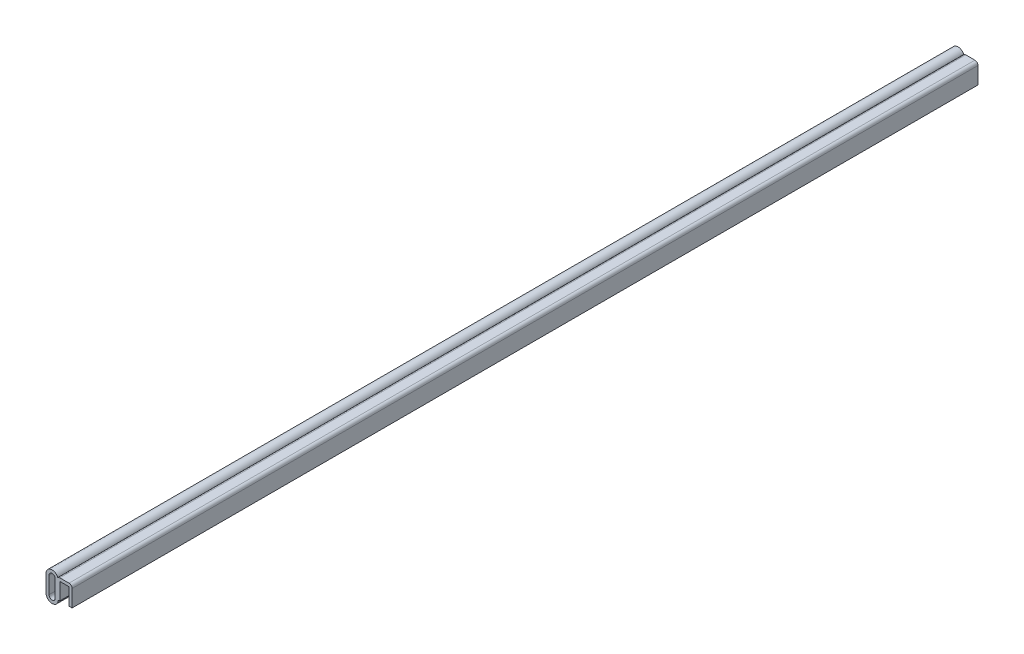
ISO-10303-21;
HEADER;
FILE_DESCRIPTION(('STEP AP214'),'2;1');
FILE_NAME('part.step','',(''),(''),'','','');
FILE_SCHEMA(('AUTOMOTIVE_DESIGN { 1 0 10303 214 1 1 1 1 }'));
ENDSEC;
DATA;
#1=APPLICATION_CONTEXT('core data for automotive mechanical design processes');
#2=APPLICATION_PROTOCOL_DEFINITION('international standard','automotive_design',2000,#1);
#3=PRODUCT_CONTEXT('',#1,'mechanical');
#4=PRODUCT('Part','Part','',(#3));
#5=PRODUCT_RELATED_PRODUCT_CATEGORY('part','',(#4));
#6=PRODUCT_DEFINITION_FORMATION('','',#4);
#7=PRODUCT_DEFINITION_CONTEXT('part definition',#1,'design');
#8=PRODUCT_DEFINITION('design','',#6,#7);
#9=PRODUCT_DEFINITION_SHAPE('','',#8);
#10=(LENGTH_UNIT() NAMED_UNIT(*) SI_UNIT(.MILLI.,.METRE.));
#11=(NAMED_UNIT(*) PLANE_ANGLE_UNIT() SI_UNIT($,.RADIAN.));
#12=(NAMED_UNIT(*) SI_UNIT($,.STERADIAN.) SOLID_ANGLE_UNIT());
#13=UNCERTAINTY_MEASURE_WITH_UNIT(LENGTH_MEASURE(1.E-05),#10,'distance_accuracy_value','');
#14=(GEOMETRIC_REPRESENTATION_CONTEXT(3) GLOBAL_UNCERTAINTY_ASSIGNED_CONTEXT((#13)) GLOBAL_UNIT_ASSIGNED_CONTEXT((#10,
#11,#12)) REPRESENTATION_CONTEXT('',''));
#15=CARTESIAN_POINT('',(0.,0.,0.));
#16=DIRECTION('',(0.,0.,1.));
#17=DIRECTION('',(1.,0.,0.));
#18=AXIS2_PLACEMENT_3D('',#15,#16,#17);
#19=CARTESIAN_POINT('',(-3.,-6.5,295.));
#20=DIRECTION('',(0.,-1.,0.));
#21=DIRECTION('',(0.,0.,-1.));
#22=AXIS2_PLACEMENT_3D('',#19,#20,#21);
#23=PLANE('',#22);
#24=DIRECTION('',(-1.,0.,0.));
#25=VECTOR('',#24,1.);
#26=CARTESIAN_POINT('',(-3.,-6.5,295.));
#27=LINE('',#26,#25);
#28=CARTESIAN_POINT('',(-3.,-6.5,295.));
#29=VERTEX_POINT('',#28);
#30=CARTESIAN_POINT('',(-4.,-6.5,295.));
#31=VERTEX_POINT('',#30);
#32=EDGE_CURVE('E222',#29,#31,#27,.T.);
#33=ORIENTED_EDGE('',*,*,#32,.T.);
#34=DIRECTION('',(0.,0.,-1.));
#35=VECTOR('',#34,1.);
#36=CARTESIAN_POINT('',(-4.,-6.5,295.));
#37=LINE('',#36,#35);
#38=CARTESIAN_POINT('',(-4.,-6.5,-295.));
#39=VERTEX_POINT('',#38);
#40=EDGE_CURVE('E208',#31,#39,#37,.T.);
#41=ORIENTED_EDGE('',*,*,#40,.T.);
#42=DIRECTION('',(-1.,0.,0.));
#43=VECTOR('',#42,1.);
#44=CARTESIAN_POINT('',(-3.,-6.5,-295.));
#45=LINE('',#44,#43);
#46=CARTESIAN_POINT('',(-3.,-6.5,-295.));
#47=VERTEX_POINT('',#46);
#48=EDGE_CURVE('E221',#47,#39,#45,.T.);
#49=ORIENTED_EDGE('',*,*,#48,.F.);
#50=DIRECTION('',(0.,0.,-1.));
#51=VECTOR('',#50,1.);
#52=CARTESIAN_POINT('',(-3.,-6.5,295.));
#53=LINE('',#52,#51);
#54=EDGE_CURVE('E269',#29,#47,#53,.T.);
#55=ORIENTED_EDGE('',*,*,#54,.F.);
#56=EDGE_LOOP('',(#33,#41,#49,#55));
#57=FACE_BOUND('',#56,.T.);
#58=ADVANCED_FACE('F46',(#57),#23,.T.);
#59=CARTESIAN_POINT('',(-3.,4.5,295.));
#60=DIRECTION('',(0.,0.,-1.));
#61=DIRECTION('',(-1.,0.,0.));
#62=AXIS2_PLACEMENT_3D('',#59,#60,#61);
#63=CYLINDRICAL_SURFACE('',#62,2.);
#64=CARTESIAN_POINT('',(-3.,4.5,-295.));
#65=DIRECTION('',(0.,0.,-1.));
#66=DIRECTION('',(-1.,0.,0.));
#67=AXIS2_PLACEMENT_3D('',#64,#65,#66);
#68=CIRCLE('',#67,2.);
#69=CARTESIAN_POINT('',(-4.3,6.01986841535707,-295.));
#70=VERTEX_POINT('',#69);
#71=CARTESIAN_POINT('',(-3.,6.5,-295.));
#72=VERTEX_POINT('',#71);
#73=EDGE_CURVE('E273',#70,#72,#68,.T.);
#74=ORIENTED_EDGE('',*,*,#73,.F.);
#75=DIRECTION('',(0.,0.,-1.));
#76=VECTOR('',#75,1.);
#77=CARTESIAN_POINT('',(-4.3,6.01986841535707,0.));
#78=LINE('',#77,#76);
#79=CARTESIAN_POINT('',(-4.3,6.01986841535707,295.));
#80=VERTEX_POINT('',#79);
#81=EDGE_CURVE('E13',#70,#80,#78,.F.);
#82=ORIENTED_EDGE('',*,*,#81,.T.);
#83=CARTESIAN_POINT('',(-3.,4.5,295.));
#84=DIRECTION('',(0.,0.,-1.));
#85=DIRECTION('',(-1.,0.,0.));
#86=AXIS2_PLACEMENT_3D('',#83,#84,#85);
#87=CIRCLE('',#86,2.);
#88=CARTESIAN_POINT('',(-3.,6.5,295.));
#89=VERTEX_POINT('',#88);
#90=EDGE_CURVE('E282',#89,#80,#87,.F.);
#91=ORIENTED_EDGE('',*,*,#90,.F.);
#92=DIRECTION('',(0.,0.,-1.));
#93=VECTOR('',#92,1.);
#94=CARTESIAN_POINT('',(-3.,6.5,295.));
#95=LINE('',#94,#93);
#96=EDGE_CURVE('E278',#72,#89,#95,.F.);
#97=ORIENTED_EDGE('',*,*,#96,.F.);
#98=EDGE_LOOP('',(#74,#82,#91,#97));
#99=FACE_BOUND('',#98,.T.);
#100=ADVANCED_FACE('F291',(#99),#63,.T.);
#101=CARTESIAN_POINT('',(-3.,-6.5,295.));
#102=DIRECTION('',(1.,0.,0.));
#103=DIRECTION('',(0.,0.,-1.));
#104=AXIS2_PLACEMENT_3D('',#101,#102,#103);
#105=PLANE('',#104);
#106=DIRECTION('',(0.,1.,0.));
#107=VECTOR('',#106,1.);
#108=CARTESIAN_POINT('',(-3.,-6.5,-295.));
#109=LINE('',#108,#107);
#110=CARTESIAN_POINT('',(-3.,4.5,-295.));
#111=VERTEX_POINT('',#110);
#112=EDGE_CURVE('E246',#111,#47,#109,.F.);
#113=ORIENTED_EDGE('',*,*,#112,.F.);
#114=DIRECTION('',(0.,0.,-1.));
#115=VECTOR('',#114,1.);
#116=CARTESIAN_POINT('',(-3.,4.5,295.));
#117=LINE('',#116,#115);
#118=CARTESIAN_POINT('',(-3.,4.5,295.));
#119=VERTEX_POINT('',#118);
#120=EDGE_CURVE('E267',#119,#111,#117,.T.);
#121=ORIENTED_EDGE('',*,*,#120,.F.);
#122=DIRECTION('',(0.,1.,0.));
#123=VECTOR('',#122,1.);
#124=CARTESIAN_POINT('',(-3.,-6.5,295.));
#125=LINE('',#124,#123);
#126=EDGE_CURVE('E225',#119,#29,#125,.F.);
#127=ORIENTED_EDGE('',*,*,#126,.T.);
#128=ORIENTED_EDGE('',*,*,#54,.T.);
#129=EDGE_LOOP('',(#113,#121,#127,#128));
#130=FACE_BOUND('',#129,.T.);
#131=ADVANCED_FACE('F313',(#130),#105,.T.);
#132=CARTESIAN_POINT('',(-5.,4.5,295.));
#133=DIRECTION('',(0.,-1.,0.));
#134=DIRECTION('',(0.,0.,-1.));
#135=AXIS2_PLACEMENT_3D('',#132,#133,#134);
#136=PLANE('',#135);
#137=DIRECTION('',(1.,0.,0.));
#138=VECTOR('',#137,1.);
#139=CARTESIAN_POINT('',(-5.,4.5,-295.));
#140=LINE('',#139,#138);
#141=CARTESIAN_POINT('',(3.,4.5,-295.));
#142=VERTEX_POINT('',#141);
#143=EDGE_CURVE('E249',#142,#111,#140,.F.);
#144=ORIENTED_EDGE('',*,*,#143,.F.);
#145=DIRECTION('',(0.,0.,-1.));
#146=VECTOR('',#145,1.);
#147=CARTESIAN_POINT('',(3.,4.5,295.));
#148=LINE('',#147,#146);
#149=CARTESIAN_POINT('',(3.,4.5,295.));
#150=VERTEX_POINT('',#149);
#151=EDGE_CURVE('E265',#150,#142,#148,.T.);
#152=ORIENTED_EDGE('',*,*,#151,.F.);
#153=DIRECTION('',(1.,0.,0.));
#154=VECTOR('',#153,1.);
#155=CARTESIAN_POINT('',(-5.,4.5,295.));
#156=LINE('',#155,#154);
#157=EDGE_CURVE('E229',#150,#119,#156,.F.);
#158=ORIENTED_EDGE('',*,*,#157,.T.);
#159=ORIENTED_EDGE('',*,*,#120,.T.);
#160=EDGE_LOOP('',(#144,#152,#158,#159));
#161=FACE_BOUND('',#160,.T.);
#162=ADVANCED_FACE('F318',(#161),#136,.T.);
#163=CARTESIAN_POINT('',(3.,-6.5,295.));
#164=DIRECTION('',(-1.,0.,0.));
#165=DIRECTION('',(0.,0.,1.));
#166=AXIS2_PLACEMENT_3D('',#163,#164,#165);
#167=PLANE('',#166);
#168=DIRECTION('',(0.,1.,0.));
#169=VECTOR('',#168,1.);
#170=CARTESIAN_POINT('',(3.,-6.5,-295.));
#171=LINE('',#170,#169);
#172=CARTESIAN_POINT('',(3.,-6.5,-295.));
#173=VERTEX_POINT('',#172);
#174=EDGE_CURVE('E252',#173,#142,#171,.T.);
#175=ORIENTED_EDGE('',*,*,#174,.F.);
#176=DIRECTION('',(0.,0.,-1.));
#177=VECTOR('',#176,1.);
#178=CARTESIAN_POINT('',(3.,-6.5,295.));
#179=LINE('',#178,#177);
#180=CARTESIAN_POINT('',(3.,-6.5,295.));
#181=VERTEX_POINT('',#180);
#182=EDGE_CURVE('E263',#181,#173,#179,.T.);
#183=ORIENTED_EDGE('',*,*,#182,.F.);
#184=DIRECTION('',(0.,1.,0.));
#185=VECTOR('',#184,1.);
#186=CARTESIAN_POINT('',(3.,-6.5,295.));
#187=LINE('',#186,#185);
#188=EDGE_CURVE('E232',#181,#150,#187,.T.);
#189=ORIENTED_EDGE('',*,*,#188,.T.);
#190=ORIENTED_EDGE('',*,*,#151,.T.);
#191=EDGE_LOOP('',(#175,#183,#189,#190));
#192=FACE_BOUND('',#191,.T.);
#193=ADVANCED_FACE('F321',(#192),#167,.T.);
#194=CARTESIAN_POINT('',(5.,-6.5,295.));
#195=DIRECTION('',(0.,-1.,0.));
#196=DIRECTION('',(0.,0.,-1.));
#197=AXIS2_PLACEMENT_3D('',#194,#195,#196);
#198=PLANE('',#197);
#199=DIRECTION('',(-1.,0.,0.));
#200=VECTOR('',#199,1.);
#201=CARTESIAN_POINT('',(5.,-6.5,-295.));
#202=LINE('',#201,#200);
#203=CARTESIAN_POINT('',(5.,-6.5,-295.));
#204=VERTEX_POINT('',#203);
#205=EDGE_CURVE('E255',#204,#173,#202,.T.);
#206=ORIENTED_EDGE('',*,*,#205,.F.);
#207=DIRECTION('',(0.,0.,-1.));
#208=VECTOR('',#207,1.);
#209=CARTESIAN_POINT('',(5.,-6.5,295.));
#210=LINE('',#209,#208);
#211=CARTESIAN_POINT('',(5.,-6.5,295.));
#212=VERTEX_POINT('',#211);
#213=EDGE_CURVE('E243',#212,#204,#210,.T.);
#214=ORIENTED_EDGE('',*,*,#213,.F.);
#215=DIRECTION('',(-1.,0.,0.));
#216=VECTOR('',#215,1.);
#217=CARTESIAN_POINT('',(5.,-6.5,295.));
#218=LINE('',#217,#216);
#219=EDGE_CURVE('E235',#212,#181,#218,.T.);
#220=ORIENTED_EDGE('',*,*,#219,.T.);
#221=ORIENTED_EDGE('',*,*,#182,.T.);
#222=EDGE_LOOP('',(#206,#214,#220,#221));
#223=FACE_BOUND('',#222,.T.);
#224=ADVANCED_FACE('F325',(#223),#198,.T.);
#225=CARTESIAN_POINT('',(5.,-6.5,295.));
#226=DIRECTION('',(-1.,0.,0.));
#227=DIRECTION('',(0.,0.,1.));
#228=AXIS2_PLACEMENT_3D('',#225,#226,#227);
#229=PLANE('',#228);
#230=DIRECTION('',(0.,1.,0.));
#231=VECTOR('',#230,1.);
#232=CARTESIAN_POINT('',(5.,-6.5,-295.));
#233=LINE('',#232,#231);
#234=CARTESIAN_POINT('',(5.,4.5,-295.));
#235=VERTEX_POINT('',#234);
#236=EDGE_CURVE('E258',#204,#235,#233,.T.);
#237=ORIENTED_EDGE('',*,*,#236,.T.);
#238=DIRECTION('',(0.,0.,-1.));
#239=VECTOR('',#238,1.);
#240=CARTESIAN_POINT('',(5.,4.5,295.));
#241=LINE('',#240,#239);
#242=CARTESIAN_POINT('',(5.,4.5,295.));
#243=VERTEX_POINT('',#242);
#244=EDGE_CURVE('E54',#235,#243,#241,.F.);
#245=ORIENTED_EDGE('',*,*,#244,.T.);
#246=DIRECTION('',(0.,1.,0.));
#247=VECTOR('',#246,1.);
#248=CARTESIAN_POINT('',(5.,-6.5,295.));
#249=LINE('',#248,#247);
#250=EDGE_CURVE('E238',#212,#243,#249,.T.);
#251=ORIENTED_EDGE('',*,*,#250,.F.);
#252=ORIENTED_EDGE('',*,*,#213,.T.);
#253=EDGE_LOOP('',(#237,#245,#251,#252));
#254=FACE_BOUND('',#253,.T.);
#255=ADVANCED_FACE('F327',(#254),#229,.F.);
#256=CARTESIAN_POINT('',(-5.,6.5,295.));
#257=DIRECTION('',(0.,-1.,0.));
#258=DIRECTION('',(0.,0.,-1.));
#259=AXIS2_PLACEMENT_3D('',#256,#257,#258);
#260=PLANE('',#259);
#261=DIRECTION('',(-1.,0.,0.));
#262=VECTOR('',#261,1.);
#263=CARTESIAN_POINT('',(-5.,6.5,-295.));
#264=LINE('',#263,#262);
#265=CARTESIAN_POINT('',(3.,6.5,-295.));
#266=VERTEX_POINT('',#265);
#267=EDGE_CURVE('E226',#266,#72,#264,.T.);
#268=ORIENTED_EDGE('',*,*,#267,.T.);
#269=ORIENTED_EDGE('',*,*,#96,.T.);
#270=DIRECTION('',(-1.,0.,0.));
#271=VECTOR('',#270,1.);
#272=CARTESIAN_POINT('',(-5.,6.5,295.));
#273=LINE('',#272,#271);
#274=CARTESIAN_POINT('',(3.,6.5,295.));
#275=VERTEX_POINT('',#274);
#276=EDGE_CURVE('E240',#275,#89,#273,.T.);
#277=ORIENTED_EDGE('',*,*,#276,.F.);
#278=DIRECTION('',(0.,0.,-1.));
#279=VECTOR('',#278,1.);
#280=CARTESIAN_POINT('',(3.,6.5,295.));
#281=LINE('',#280,#279);
#282=EDGE_CURVE('E275',#275,#266,#281,.T.);
#283=ORIENTED_EDGE('',*,*,#282,.T.);
#284=EDGE_LOOP('',(#268,#269,#277,#283));
#285=FACE_BOUND('',#284,.T.);
#286=ADVANCED_FACE('F332',(#285),#260,.F.);
#287=CARTESIAN_POINT('',(-5.,-6.5,295.));
#288=DIRECTION('',(0.,0.,-1.));
#289=DIRECTION('',(-1.,0.,0.));
#290=AXIS2_PLACEMENT_3D('',#287,#288,#289);
#291=PLANE('',#290);
#292=CARTESIAN_POINT('',(-8.,-6.5,295.));
#293=DIRECTION('',(0.,0.,1.));
#294=DIRECTION('',(1.,0.,0.));
#295=AXIS2_PLACEMENT_3D('',#292,#293,#294);
#296=CIRCLE('',#295,4.);
#297=CARTESIAN_POINT('',(-12.,-6.5,295.));
#298=VERTEX_POINT('',#297);
#299=EDGE_CURVE('E206',#298,#31,#296,.T.);
#300=ORIENTED_EDGE('',*,*,#299,.T.);
#301=ORIENTED_EDGE('',*,*,#32,.F.);
#302=ORIENTED_EDGE('',*,*,#126,.F.);
#303=ORIENTED_EDGE('',*,*,#157,.F.);
#304=ORIENTED_EDGE('',*,*,#188,.F.);
#305=ORIENTED_EDGE('',*,*,#219,.F.);
#306=ORIENTED_EDGE('',*,*,#250,.T.);
#307=CARTESIAN_POINT('',(3.,4.5,295.));
#308=DIRECTION('',(0.,0.,-1.));
#309=DIRECTION('',(-1.,0.,0.));
#310=AXIS2_PLACEMENT_3D('',#307,#308,#309);
#311=CIRCLE('',#310,2.);
#312=EDGE_CURVE('E280',#243,#275,#311,.F.);
#313=ORIENTED_EDGE('',*,*,#312,.T.);
#314=ORIENTED_EDGE('',*,*,#276,.T.);
#315=ORIENTED_EDGE('',*,*,#90,.T.);
#316=CARTESIAN_POINT('',(-8.,4.5,295.));
#317=DIRECTION('',(0.,0.,1.));
#318=DIRECTION('',(-1.,0.,0.));
#319=AXIS2_PLACEMENT_3D('',#316,#317,#318);
#320=CIRCLE('',#319,4.);
#321=CARTESIAN_POINT('',(-12.,4.5,295.));
#322=VERTEX_POINT('',#321);
#323=EDGE_CURVE('E61',#80,#322,#320,.T.);
#324=ORIENTED_EDGE('',*,*,#323,.T.);
#325=DIRECTION('',(0.,-1.,0.));
#326=VECTOR('',#325,1.);
#327=CARTESIAN_POINT('',(-12.,4.5,295.));
#328=LINE('',#327,#326);
#329=EDGE_CURVE('E203',#322,#298,#328,.T.);
#330=ORIENTED_EDGE('',*,*,#329,.T.);
#331=EDGE_LOOP('',(#300,#301,#302,#303,#304,#305,#306,#313,#314,#315,#324,#330));
#332=FACE_BOUND('',#331,.T.);
#333=CARTESIAN_POINT('',(-8.,4.5,295.));
#334=DIRECTION('',(0.,0.,1.));
#335=DIRECTION('',(-1.,0.,0.));
#336=AXIS2_PLACEMENT_3D('',#333,#334,#335);
#337=CIRCLE('',#336,2.);
#338=CARTESIAN_POINT('',(-6.,4.5,295.));
#339=VERTEX_POINT('',#338);
#340=CARTESIAN_POINT('',(-10.,4.5,295.));
#341=VERTEX_POINT('',#340);
#342=EDGE_CURVE('E160',#339,#341,#337,.T.);
#343=ORIENTED_EDGE('',*,*,#342,.F.);
#344=DIRECTION('',(0.,1.,0.));
#345=VECTOR('',#344,1.);
#346=CARTESIAN_POINT('',(-6.,4.5,295.));
#347=LINE('',#346,#345);
#348=CARTESIAN_POINT('',(-6.,-6.5,295.));
#349=VERTEX_POINT('',#348);
#350=EDGE_CURVE('E186',#349,#339,#347,.T.);
#351=ORIENTED_EDGE('',*,*,#350,.F.);
#352=CARTESIAN_POINT('',(-8.,-6.5,295.));
#353=DIRECTION('',(0.,0.,1.));
#354=DIRECTION('',(1.,0.,0.));
#355=AXIS2_PLACEMENT_3D('',#352,#353,#354);
#356=CIRCLE('',#355,2.);
#357=CARTESIAN_POINT('',(-10.,-6.5,295.));
#358=VERTEX_POINT('',#357);
#359=EDGE_CURVE('E184',#358,#349,#356,.T.);
#360=ORIENTED_EDGE('',*,*,#359,.F.);
#361=DIRECTION('',(0.,-1.,0.));
#362=VECTOR('',#361,1.);
#363=CARTESIAN_POINT('',(-10.,4.5,295.));
#364=LINE('',#363,#362);
#365=EDGE_CURVE('E170',#341,#358,#364,.T.);
#366=ORIENTED_EDGE('',*,*,#365,.F.);
#367=EDGE_LOOP('',(#343,#351,#360,#366));
#368=FACE_BOUND('',#367,.T.);
#369=ADVANCED_FACE('F182',(#332,#368),#291,.F.);
#370=CARTESIAN_POINT('',(-5.,-6.5,-295.));
#371=DIRECTION('',(0.,0.,-1.));
#372=DIRECTION('',(-1.,0.,0.));
#373=AXIS2_PLACEMENT_3D('',#370,#371,#372);
#374=PLANE('',#373);
#375=ORIENTED_EDGE('',*,*,#48,.T.);
#376=CARTESIAN_POINT('',(-8.,-6.5,-295.));
#377=DIRECTION('',(0.,0.,1.));
#378=DIRECTION('',(1.,0.,0.));
#379=AXIS2_PLACEMENT_3D('',#376,#377,#378);
#380=CIRCLE('',#379,4.);
#381=CARTESIAN_POINT('',(-12.,-6.5,-295.));
#382=VERTEX_POINT('',#381);
#383=EDGE_CURVE('E204',#382,#39,#380,.T.);
#384=ORIENTED_EDGE('',*,*,#383,.F.);
#385=DIRECTION('',(0.,-1.,0.));
#386=VECTOR('',#385,1.);
#387=CARTESIAN_POINT('',(-12.,4.5,-295.));
#388=LINE('',#387,#386);
#389=CARTESIAN_POINT('',(-12.,4.5,-295.));
#390=VERTEX_POINT('',#389);
#391=EDGE_CURVE('E210',#390,#382,#388,.T.);
#392=ORIENTED_EDGE('',*,*,#391,.F.);
#393=CARTESIAN_POINT('',(-8.,4.5,-295.));
#394=DIRECTION('',(0.,0.,1.));
#395=DIRECTION('',(-1.,0.,0.));
#396=AXIS2_PLACEMENT_3D('',#393,#394,#395);
#397=CIRCLE('',#396,4.);
#398=EDGE_CURVE('E178',#70,#390,#397,.T.);
#399=ORIENTED_EDGE('',*,*,#398,.F.);
#400=ORIENTED_EDGE('',*,*,#73,.T.);
#401=ORIENTED_EDGE('',*,*,#267,.F.);
#402=CARTESIAN_POINT('',(3.,4.5,-295.));
#403=DIRECTION('',(0.,0.,-1.));
#404=DIRECTION('',(-1.,0.,0.));
#405=AXIS2_PLACEMENT_3D('',#402,#403,#404);
#406=CIRCLE('',#405,2.);
#407=EDGE_CURVE('E271',#266,#235,#406,.T.);
#408=ORIENTED_EDGE('',*,*,#407,.T.);
#409=ORIENTED_EDGE('',*,*,#236,.F.);
#410=ORIENTED_EDGE('',*,*,#205,.T.);
#411=ORIENTED_EDGE('',*,*,#174,.T.);
#412=ORIENTED_EDGE('',*,*,#143,.T.);
#413=ORIENTED_EDGE('',*,*,#112,.T.);
#414=EDGE_LOOP('',(#375,#384,#392,#399,#400,#401,#408,#409,#410,#411,#412,#413));
#415=FACE_BOUND('',#414,.T.);
#416=DIRECTION('',(0.,1.,0.));
#417=VECTOR('',#416,1.);
#418=CARTESIAN_POINT('',(-6.,4.5,-295.));
#419=LINE('',#418,#417);
#420=CARTESIAN_POINT('',(-6.,-6.5,-295.));
#421=VERTEX_POINT('',#420);
#422=CARTESIAN_POINT('',(-6.,4.5,-295.));
#423=VERTEX_POINT('',#422);
#424=EDGE_CURVE('E171',#421,#423,#419,.T.);
#425=ORIENTED_EDGE('',*,*,#424,.T.);
#426=CARTESIAN_POINT('',(-8.,4.5,-295.));
#427=DIRECTION('',(0.,0.,1.));
#428=DIRECTION('',(-1.,0.,0.));
#429=AXIS2_PLACEMENT_3D('',#426,#427,#428);
#430=CIRCLE('',#429,2.);
#431=CARTESIAN_POINT('',(-10.,4.5,-295.));
#432=VERTEX_POINT('',#431);
#433=EDGE_CURVE('E190',#423,#432,#430,.T.);
#434=ORIENTED_EDGE('',*,*,#433,.T.);
#435=DIRECTION('',(0.,-1.,0.));
#436=VECTOR('',#435,1.);
#437=CARTESIAN_POINT('',(-10.,4.5,-295.));
#438=LINE('',#437,#436);
#439=CARTESIAN_POINT('',(-10.,-6.5,-295.));
#440=VERTEX_POINT('',#439);
#441=EDGE_CURVE('E177',#432,#440,#438,.T.);
#442=ORIENTED_EDGE('',*,*,#441,.T.);
#443=CARTESIAN_POINT('',(-8.,-6.5,-295.));
#444=DIRECTION('',(0.,0.,1.));
#445=DIRECTION('',(1.,0.,0.));
#446=AXIS2_PLACEMENT_3D('',#443,#444,#445);
#447=CIRCLE('',#446,2.);
#448=EDGE_CURVE('E193',#440,#421,#447,.T.);
#449=ORIENTED_EDGE('',*,*,#448,.T.);
#450=EDGE_LOOP('',(#425,#434,#442,#449));
#451=FACE_BOUND('',#450,.T.);
#452=ADVANCED_FACE('F296',(#415,#451),#374,.T.);
#453=CARTESIAN_POINT('',(3.,4.5,295.));
#454=DIRECTION('',(0.,0.,-1.));
#455=DIRECTION('',(-1.,0.,0.));
#456=AXIS2_PLACEMENT_3D('',#453,#454,#455);
#457=CYLINDRICAL_SURFACE('',#456,2.);
#458=ORIENTED_EDGE('',*,*,#312,.F.);
#459=ORIENTED_EDGE('',*,*,#244,.F.);
#460=ORIENTED_EDGE('',*,*,#407,.F.);
#461=ORIENTED_EDGE('',*,*,#282,.F.);
#462=EDGE_LOOP('',(#458,#459,#460,#461));
#463=FACE_BOUND('',#462,.T.);
#464=ADVANCED_FACE('F48',(#463),#457,.T.);
#465=CARTESIAN_POINT('',(-8.,4.5,295.));
#466=DIRECTION('',(0.,0.,-1.));
#467=DIRECTION('',(-1.,0.,0.));
#468=AXIS2_PLACEMENT_3D('',#465,#466,#467);
#469=CYLINDRICAL_SURFACE('',#468,4.);
#470=ORIENTED_EDGE('',*,*,#81,.F.);
#471=ORIENTED_EDGE('',*,*,#398,.T.);
#472=DIRECTION('',(0.,0.,-1.));
#473=VECTOR('',#472,1.);
#474=CARTESIAN_POINT('',(-12.,4.5,295.));
#475=LINE('',#474,#473);
#476=EDGE_CURVE('E218',#322,#390,#475,.T.);
#477=ORIENTED_EDGE('',*,*,#476,.F.);
#478=ORIENTED_EDGE('',*,*,#323,.F.);
#479=EDGE_LOOP('',(#470,#471,#477,#478));
#480=FACE_BOUND('',#479,.T.);
#481=ADVANCED_FACE('F293',(#480),#469,.T.);
#482=CARTESIAN_POINT('',(-12.,4.5,295.));
#483=DIRECTION('',(1.,0.,0.));
#484=DIRECTION('',(0.,0.,-1.));
#485=AXIS2_PLACEMENT_3D('',#482,#483,#484);
#486=PLANE('',#485);
#487=ORIENTED_EDGE('',*,*,#391,.T.);
#488=DIRECTION('',(0.,0.,-1.));
#489=VECTOR('',#488,1.);
#490=CARTESIAN_POINT('',(-12.,-6.5,295.));
#491=LINE('',#490,#489);
#492=EDGE_CURVE('E215',#298,#382,#491,.T.);
#493=ORIENTED_EDGE('',*,*,#492,.F.);
#494=ORIENTED_EDGE('',*,*,#329,.F.);
#495=ORIENTED_EDGE('',*,*,#476,.T.);
#496=EDGE_LOOP('',(#487,#493,#494,#495));
#497=FACE_BOUND('',#496,.T.);
#498=ADVANCED_FACE('F302',(#497),#486,.F.);
#499=CARTESIAN_POINT('',(-8.,-6.5,295.));
#500=DIRECTION('',(0.,0.,-1.));
#501=DIRECTION('',(-1.,0.,0.));
#502=AXIS2_PLACEMENT_3D('',#499,#500,#501);
#503=CYLINDRICAL_SURFACE('',#502,4.);
#504=ORIENTED_EDGE('',*,*,#383,.T.);
#505=ORIENTED_EDGE('',*,*,#40,.F.);
#506=ORIENTED_EDGE('',*,*,#299,.F.);
#507=ORIENTED_EDGE('',*,*,#492,.T.);
#508=EDGE_LOOP('',(#504,#505,#506,#507));
#509=FACE_BOUND('',#508,.T.);
#510=ADVANCED_FACE('F308',(#509),#503,.T.);
#511=CARTESIAN_POINT('',(-8.,4.5,295.));
#512=DIRECTION('',(0.,0.,-1.));
#513=DIRECTION('',(-1.,0.,0.));
#514=AXIS2_PLACEMENT_3D('',#511,#512,#513);
#515=CYLINDRICAL_SURFACE('',#514,2.);
#516=ORIENTED_EDGE('',*,*,#433,.F.);
#517=DIRECTION('',(0.,0.,-1.));
#518=VECTOR('',#517,1.);
#519=CARTESIAN_POINT('',(-6.,4.5,295.));
#520=LINE('',#519,#518);
#521=EDGE_CURVE('E166',#339,#423,#520,.T.);
#522=ORIENTED_EDGE('',*,*,#521,.F.);
#523=ORIENTED_EDGE('',*,*,#342,.T.);
#524=DIRECTION('',(0.,0.,-1.));
#525=VECTOR('',#524,1.);
#526=CARTESIAN_POINT('',(-10.,4.5,295.));
#527=LINE('',#526,#525);
#528=EDGE_CURVE('E163',#341,#432,#527,.T.);
#529=ORIENTED_EDGE('',*,*,#528,.T.);
#530=EDGE_LOOP('',(#516,#522,#523,#529));
#531=FACE_BOUND('',#530,.T.);
#532=ADVANCED_FACE('F162',(#531),#515,.F.);
#533=CARTESIAN_POINT('',(-10.,4.5,295.));
#534=DIRECTION('',(1.,0.,0.));
#535=DIRECTION('',(0.,0.,-1.));
#536=AXIS2_PLACEMENT_3D('',#533,#534,#535);
#537=PLANE('',#536);
#538=ORIENTED_EDGE('',*,*,#441,.F.);
#539=ORIENTED_EDGE('',*,*,#528,.F.);
#540=ORIENTED_EDGE('',*,*,#365,.T.);
#541=DIRECTION('',(0.,0.,-1.));
#542=VECTOR('',#541,1.);
#543=CARTESIAN_POINT('',(-10.,-6.5,295.));
#544=LINE('',#543,#542);
#545=EDGE_CURVE('E179',#358,#440,#544,.T.);
#546=ORIENTED_EDGE('',*,*,#545,.T.);
#547=EDGE_LOOP('',(#538,#539,#540,#546));
#548=FACE_BOUND('',#547,.T.);
#549=ADVANCED_FACE('F174',(#548),#537,.T.);
#550=CARTESIAN_POINT('',(-8.,-6.5,295.));
#551=DIRECTION('',(0.,0.,-1.));
#552=DIRECTION('',(-1.,0.,0.));
#553=AXIS2_PLACEMENT_3D('',#550,#551,#552);
#554=CYLINDRICAL_SURFACE('',#553,2.);
#555=ORIENTED_EDGE('',*,*,#448,.F.);
#556=ORIENTED_EDGE('',*,*,#545,.F.);
#557=ORIENTED_EDGE('',*,*,#359,.T.);
#558=DIRECTION('',(0.,0.,-1.));
#559=VECTOR('',#558,1.);
#560=CARTESIAN_POINT('',(-6.,-6.5,295.));
#561=LINE('',#560,#559);
#562=EDGE_CURVE('E199',#349,#421,#561,.T.);
#563=ORIENTED_EDGE('',*,*,#562,.T.);
#564=EDGE_LOOP('',(#555,#556,#557,#563));
#565=FACE_BOUND('',#564,.T.);
#566=ADVANCED_FACE('F440',(#565),#554,.F.);
#567=CARTESIAN_POINT('',(-6.,4.5,295.));
#568=DIRECTION('',(-1.,0.,0.));
#569=DIRECTION('',(0.,-1.,0.));
#570=AXIS2_PLACEMENT_3D('',#567,#568,#569);
#571=PLANE('',#570);
#572=ORIENTED_EDGE('',*,*,#424,.F.);
#573=ORIENTED_EDGE('',*,*,#562,.F.);
#574=ORIENTED_EDGE('',*,*,#350,.T.);
#575=ORIENTED_EDGE('',*,*,#521,.T.);
#576=EDGE_LOOP('',(#572,#573,#574,#575));
#577=FACE_BOUND('',#576,.T.);
#578=ADVANCED_FACE('F449',(#577),#571,.T.);
#579=CLOSED_SHELL('',(#58,#100,#131,#162,#193,#224,#255,#286,#369,#452,#464,#481,#498,#510,#532,
#549,#566,#578));
#580=MANIFOLD_SOLID_BREP('B2',#579);
#581=ADVANCED_BREP_SHAPE_REPRESENTATION('',(#18,#580),#14);
#582=SHAPE_DEFINITION_REPRESENTATION(#9,#581);
ENDSEC;
END-ISO-10303-21;
